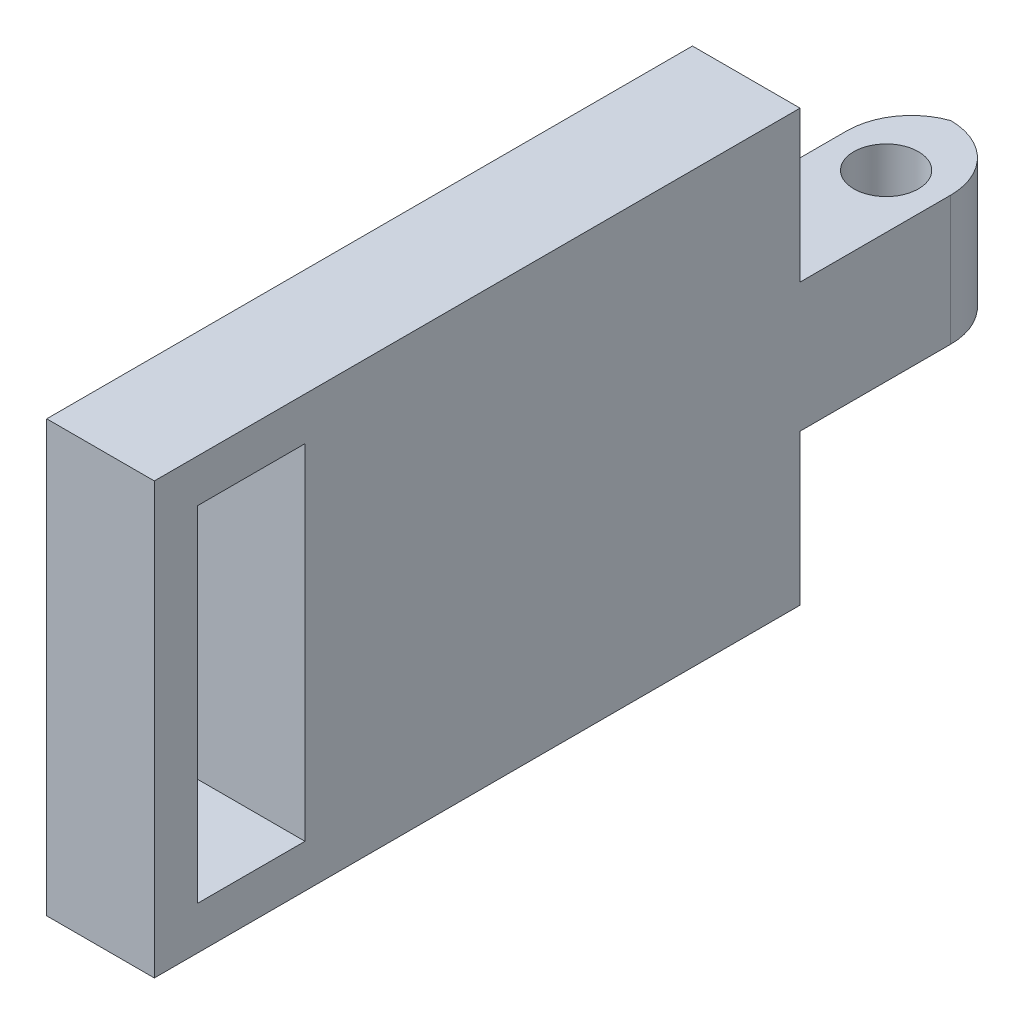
ISO-10303-21;
HEADER;
FILE_DESCRIPTION(('STEP AP214'),'2;1');
FILE_NAME('part.step','',(''),(''),'','','');
FILE_SCHEMA(('AUTOMOTIVE_DESIGN { 1 0 10303 214 1 1 1 1 }'));
ENDSEC;
DATA;
#1=APPLICATION_CONTEXT('core data for automotive mechanical design processes');
#2=APPLICATION_PROTOCOL_DEFINITION('international standard','automotive_design',2000,#1);
#3=PRODUCT_CONTEXT('',#1,'mechanical');
#4=PRODUCT('Part','Part','',(#3));
#5=PRODUCT_RELATED_PRODUCT_CATEGORY('part','',(#4));
#6=PRODUCT_DEFINITION_FORMATION('','',#4);
#7=PRODUCT_DEFINITION_CONTEXT('part definition',#1,'design');
#8=PRODUCT_DEFINITION('design','',#6,#7);
#9=PRODUCT_DEFINITION_SHAPE('','',#8);
#10=(LENGTH_UNIT() NAMED_UNIT(*) SI_UNIT(.MILLI.,.METRE.));
#11=(NAMED_UNIT(*) PLANE_ANGLE_UNIT() SI_UNIT($,.RADIAN.));
#12=(NAMED_UNIT(*) SI_UNIT($,.STERADIAN.) SOLID_ANGLE_UNIT());
#13=UNCERTAINTY_MEASURE_WITH_UNIT(LENGTH_MEASURE(1.E-05),#10,'distance_accuracy_value','');
#14=(GEOMETRIC_REPRESENTATION_CONTEXT(3) GLOBAL_UNCERTAINTY_ASSIGNED_CONTEXT((#13)) GLOBAL_UNIT_ASSIGNED_CONTEXT((#10,
#11,#12)) REPRESENTATION_CONTEXT('',''));
#15=CARTESIAN_POINT('',(0.,0.,0.));
#16=DIRECTION('',(0.,0.,1.));
#17=DIRECTION('',(1.,0.,0.));
#18=AXIS2_PLACEMENT_3D('',#15,#16,#17);
#19=CARTESIAN_POINT('',(5.,0.,-30.));
#20=DIRECTION('',(0.,0.,1.));
#21=DIRECTION('',(1.,0.,0.));
#22=AXIS2_PLACEMENT_3D('',#19,#20,#21);
#23=PLANE('',#22);
#24=DIRECTION('',(1.,0.,0.));
#25=VECTOR('',#24,1.);
#26=CARTESIAN_POINT('',(5.,13.,-30.));
#27=LINE('',#26,#25);
#28=CARTESIAN_POINT('',(0.,13.,-30.));
#29=VERTEX_POINT('',#28);
#30=CARTESIAN_POINT('',(5.,13.,-30.));
#31=VERTEX_POINT('',#30);
#32=EDGE_CURVE('E182',#29,#31,#27,.T.);
#33=ORIENTED_EDGE('',*,*,#32,.F.);
#34=DIRECTION('',(0.,1.,0.));
#35=VECTOR('',#34,1.);
#36=CARTESIAN_POINT('',(0.,0.,-30.));
#37=LINE('',#36,#35);
#38=CARTESIAN_POINT('',(0.,20.,-30.));
#39=VERTEX_POINT('',#38);
#40=EDGE_CURVE('E222',#29,#39,#37,.T.);
#41=ORIENTED_EDGE('',*,*,#40,.T.);
#42=DIRECTION('',(-1.,0.,0.));
#43=VECTOR('',#42,1.);
#44=CARTESIAN_POINT('',(5.,20.,-30.));
#45=LINE('',#44,#43);
#46=CARTESIAN_POINT('',(5.,20.,-30.));
#47=VERTEX_POINT('',#46);
#48=EDGE_CURVE('E232',#47,#39,#45,.T.);
#49=ORIENTED_EDGE('',*,*,#48,.F.);
#50=DIRECTION('',(0.,1.,0.));
#51=VECTOR('',#50,1.);
#52=CARTESIAN_POINT('',(5.,0.,-30.));
#53=LINE('',#52,#51);
#54=EDGE_CURVE('E207',#31,#47,#53,.T.);
#55=ORIENTED_EDGE('',*,*,#54,.F.);
#56=EDGE_LOOP('',(#33,#41,#49,#55));
#57=FACE_BOUND('',#56,.T.);
#58=ADVANCED_FACE('F43',(#57),#23,.F.);
#59=DIRECTION('',(-1.,0.,0.));
#60=VECTOR('',#59,1.);
#61=CARTESIAN_POINT('',(5.,7.,-30.));
#62=LINE('',#61,#60);
#63=CARTESIAN_POINT('',(5.,7.,-30.));
#64=VERTEX_POINT('',#63);
#65=CARTESIAN_POINT('',(0.,7.,-30.));
#66=VERTEX_POINT('',#65);
#67=EDGE_CURVE('E178',#64,#66,#62,.T.);
#68=ORIENTED_EDGE('',*,*,#67,.F.);
#69=CARTESIAN_POINT('',(5.,0.,-30.));
#70=VERTEX_POINT('',#69);
#71=EDGE_CURVE('E208',#70,#64,#53,.T.);
#72=ORIENTED_EDGE('',*,*,#71,.F.);
#73=DIRECTION('',(-1.,0.,0.));
#74=VECTOR('',#73,1.);
#75=CARTESIAN_POINT('',(5.,0.,-30.));
#76=LINE('',#75,#74);
#77=CARTESIAN_POINT('',(0.,0.,-30.));
#78=VERTEX_POINT('',#77);
#79=EDGE_CURVE('E236',#70,#78,#76,.T.);
#80=ORIENTED_EDGE('',*,*,#79,.T.);
#81=EDGE_CURVE('E223',#78,#66,#37,.T.);
#82=ORIENTED_EDGE('',*,*,#81,.T.);
#83=EDGE_LOOP('',(#68,#72,#80,#82));
#84=FACE_BOUND('',#83,.T.);
#85=ADVANCED_FACE('F294',(#84),#23,.F.);
#86=CARTESIAN_POINT('',(5.,0.,0.));
#87=DIRECTION('',(0.,0.,-1.));
#88=DIRECTION('',(-1.,0.,0.));
#89=AXIS2_PLACEMENT_3D('',#86,#87,#88);
#90=PLANE('',#89);
#91=DIRECTION('',(0.,-1.,0.));
#92=VECTOR('',#91,1.);
#93=CARTESIAN_POINT('',(0.,0.,0.));
#94=LINE('',#93,#92);
#95=CARTESIAN_POINT('',(0.,20.,0.));
#96=VERTEX_POINT('',#95);
#97=CARTESIAN_POINT('',(0.,0.,0.));
#98=VERTEX_POINT('',#97);
#99=EDGE_CURVE('E198',#96,#98,#94,.T.);
#100=ORIENTED_EDGE('',*,*,#99,.T.);
#101=DIRECTION('',(-1.,0.,0.));
#102=VECTOR('',#101,1.);
#103=CARTESIAN_POINT('',(5.,0.,0.));
#104=LINE('',#103,#102);
#105=CARTESIAN_POINT('',(5.,0.,0.));
#106=VERTEX_POINT('',#105);
#107=EDGE_CURVE('E240',#106,#98,#104,.T.);
#108=ORIENTED_EDGE('',*,*,#107,.F.);
#109=DIRECTION('',(0.,-1.,0.));
#110=VECTOR('',#109,1.);
#111=CARTESIAN_POINT('',(5.,0.,0.));
#112=LINE('',#111,#110);
#113=CARTESIAN_POINT('',(5.,20.,0.));
#114=VERTEX_POINT('',#113);
#115=EDGE_CURVE('E199',#114,#106,#112,.T.);
#116=ORIENTED_EDGE('',*,*,#115,.F.);
#117=DIRECTION('',(-1.,0.,0.));
#118=VECTOR('',#117,1.);
#119=CARTESIAN_POINT('',(5.,20.,0.));
#120=LINE('',#119,#118);
#121=EDGE_CURVE('E215',#114,#96,#120,.T.);
#122=ORIENTED_EDGE('',*,*,#121,.T.);
#123=EDGE_LOOP('',(#100,#108,#116,#122));
#124=FACE_BOUND('',#123,.T.);
#125=ADVANCED_FACE('F300',(#124),#90,.F.);
#126=CARTESIAN_POINT('',(5.,0.,0.));
#127=DIRECTION('',(0.,1.,0.));
#128=DIRECTION('',(0.,0.,1.));
#129=AXIS2_PLACEMENT_3D('',#126,#127,#128);
#130=PLANE('',#129);
#131=DIRECTION('',(0.,0.,-1.));
#132=VECTOR('',#131,1.);
#133=CARTESIAN_POINT('',(0.,0.,0.));
#134=LINE('',#133,#132);
#135=EDGE_CURVE('E219',#98,#78,#134,.T.);
#136=ORIENTED_EDGE('',*,*,#135,.T.);
#137=ORIENTED_EDGE('',*,*,#79,.F.);
#138=DIRECTION('',(0.,0.,-1.));
#139=VECTOR('',#138,1.);
#140=CARTESIAN_POINT('',(5.,0.,0.));
#141=LINE('',#140,#139);
#142=EDGE_CURVE('E203',#106,#70,#141,.T.);
#143=ORIENTED_EDGE('',*,*,#142,.F.);
#144=ORIENTED_EDGE('',*,*,#107,.T.);
#145=EDGE_LOOP('',(#136,#137,#143,#144));
#146=FACE_BOUND('',#145,.T.);
#147=ADVANCED_FACE('F307',(#146),#130,.F.);
#148=CARTESIAN_POINT('',(5.,20.,0.));
#149=DIRECTION('',(0.,-1.,0.));
#150=DIRECTION('',(0.,0.,-1.));
#151=AXIS2_PLACEMENT_3D('',#148,#149,#150);
#152=PLANE('',#151);
#153=DIRECTION('',(0.,0.,1.));
#154=VECTOR('',#153,1.);
#155=CARTESIAN_POINT('',(0.,20.,0.));
#156=LINE('',#155,#154);
#157=EDGE_CURVE('E204',#39,#96,#156,.T.);
#158=ORIENTED_EDGE('',*,*,#157,.T.);
#159=ORIENTED_EDGE('',*,*,#121,.F.);
#160=DIRECTION('',(0.,0.,1.));
#161=VECTOR('',#160,1.);
#162=CARTESIAN_POINT('',(5.,20.,0.));
#163=LINE('',#162,#161);
#164=EDGE_CURVE('E212',#47,#114,#163,.T.);
#165=ORIENTED_EDGE('',*,*,#164,.F.);
#166=ORIENTED_EDGE('',*,*,#48,.T.);
#167=EDGE_LOOP('',(#158,#159,#165,#166));
#168=FACE_BOUND('',#167,.T.);
#169=ADVANCED_FACE('F305',(#168),#152,.F.);
#170=CARTESIAN_POINT('',(5.,0.,0.));
#171=DIRECTION('',(-1.,0.,0.));
#172=DIRECTION('',(0.,0.,1.));
#173=AXIS2_PLACEMENT_3D('',#170,#171,#172);
#174=PLANE('',#173);
#175=DIRECTION('',(0.,-1.,0.));
#176=VECTOR('',#175,1.);
#177=CARTESIAN_POINT('',(5.,18.,-7.));
#178=LINE('',#177,#176);
#179=CARTESIAN_POINT('',(5.,18.,-7.));
#180=VERTEX_POINT('',#179);
#181=CARTESIAN_POINT('',(5.,2.,-7.));
#182=VERTEX_POINT('',#181);
#183=EDGE_CURVE('E152',#180,#182,#178,.T.);
#184=ORIENTED_EDGE('',*,*,#183,.T.);
#185=DIRECTION('',(0.,0.,1.));
#186=VECTOR('',#185,1.);
#187=CARTESIAN_POINT('',(5.,2.,-7.));
#188=LINE('',#187,#186);
#189=CARTESIAN_POINT('',(5.,2.,-2.));
#190=VERTEX_POINT('',#189);
#191=EDGE_CURVE('E142',#182,#190,#188,.T.);
#192=ORIENTED_EDGE('',*,*,#191,.T.);
#193=DIRECTION('',(0.,-1.,0.));
#194=VECTOR('',#193,1.);
#195=CARTESIAN_POINT('',(5.,18.,-2.));
#196=LINE('',#195,#194);
#197=CARTESIAN_POINT('',(5.,18.,-2.));
#198=VERTEX_POINT('',#197);
#199=EDGE_CURVE('E135',#198,#190,#196,.T.);
#200=ORIENTED_EDGE('',*,*,#199,.F.);
#201=DIRECTION('',(0.,0.,1.));
#202=VECTOR('',#201,1.);
#203=CARTESIAN_POINT('',(5.,18.,-7.));
#204=LINE('',#203,#202);
#205=EDGE_CURVE('E141',#180,#198,#204,.T.);
#206=ORIENTED_EDGE('',*,*,#205,.F.);
#207=EDGE_LOOP('',(#184,#192,#200,#206));
#208=FACE_BOUND('',#207,.T.);
#209=DIRECTION('',(0.,0.,1.));
#210=VECTOR('',#209,1.);
#211=CARTESIAN_POINT('',(5.,7.,-40.));
#212=LINE('',#211,#210);
#213=CARTESIAN_POINT('',(5.,7.,-37.));
#214=VERTEX_POINT('',#213);
#215=EDGE_CURVE('E195',#214,#64,#212,.T.);
#216=ORIENTED_EDGE('',*,*,#215,.F.);
#217=DIRECTION('',(0.,-1.,0.));
#218=VECTOR('',#217,1.);
#219=CARTESIAN_POINT('',(5.,13.,-37.));
#220=LINE('',#219,#218);
#221=CARTESIAN_POINT('',(5.,13.,-37.));
#222=VERTEX_POINT('',#221);
#223=EDGE_CURVE('E251',#214,#222,#220,.F.);
#224=ORIENTED_EDGE('',*,*,#223,.T.);
#225=DIRECTION('',(0.,0.,1.));
#226=VECTOR('',#225,1.);
#227=CARTESIAN_POINT('',(5.,13.,-40.));
#228=LINE('',#227,#226);
#229=EDGE_CURVE('E186',#222,#31,#228,.T.);
#230=ORIENTED_EDGE('',*,*,#229,.T.);
#231=ORIENTED_EDGE('',*,*,#54,.T.);
#232=ORIENTED_EDGE('',*,*,#164,.T.);
#233=ORIENTED_EDGE('',*,*,#115,.T.);
#234=ORIENTED_EDGE('',*,*,#142,.T.);
#235=ORIENTED_EDGE('',*,*,#71,.T.);
#236=EDGE_LOOP('',(#216,#224,#230,#231,#232,#233,#234,#235));
#237=FACE_BOUND('',#236,.T.);
#238=ADVANCED_FACE('F154',(#208,#237),#174,.F.);
#239=CARTESIAN_POINT('',(0.,0.,0.));
#240=DIRECTION('',(-1.,0.,0.));
#241=DIRECTION('',(0.,0.,1.));
#242=AXIS2_PLACEMENT_3D('',#239,#240,#241);
#243=PLANE('',#242);
#244=DIRECTION('',(0.,0.,1.));
#245=VECTOR('',#244,1.);
#246=CARTESIAN_POINT('',(0.,2.,0.));
#247=LINE('',#246,#245);
#248=CARTESIAN_POINT('',(0.,2.,-7.));
#249=VERTEX_POINT('',#248);
#250=CARTESIAN_POINT('',(0.,2.,-2.));
#251=VERTEX_POINT('',#250);
#252=EDGE_CURVE('E11',#249,#251,#247,.T.);
#253=ORIENTED_EDGE('',*,*,#252,.F.);
#254=DIRECTION('',(0.,-1.,0.));
#255=VECTOR('',#254,1.);
#256=CARTESIAN_POINT('',(0.,0.,-7.));
#257=LINE('',#256,#255);
#258=CARTESIAN_POINT('',(0.,18.,-7.));
#259=VERTEX_POINT('',#258);
#260=EDGE_CURVE('E52',#259,#249,#257,.T.);
#261=ORIENTED_EDGE('',*,*,#260,.F.);
#262=DIRECTION('',(0.,0.,1.));
#263=VECTOR('',#262,1.);
#264=CARTESIAN_POINT('',(0.,18.,0.));
#265=LINE('',#264,#263);
#266=CARTESIAN_POINT('',(0.,18.,-2.));
#267=VERTEX_POINT('',#266);
#268=EDGE_CURVE('E273',#259,#267,#265,.T.);
#269=ORIENTED_EDGE('',*,*,#268,.T.);
#270=DIRECTION('',(0.,-1.,0.));
#271=VECTOR('',#270,1.);
#272=CARTESIAN_POINT('',(0.,0.,-2.));
#273=LINE('',#272,#271);
#274=EDGE_CURVE('E267',#267,#251,#273,.T.);
#275=ORIENTED_EDGE('',*,*,#274,.T.);
#276=EDGE_LOOP('',(#253,#261,#269,#275));
#277=FACE_BOUND('',#276,.T.);
#278=DIRECTION('',(0.,0.,1.));
#279=VECTOR('',#278,1.);
#280=CARTESIAN_POINT('',(0.,13.,-40.));
#281=LINE('',#280,#279);
#282=CARTESIAN_POINT('',(0.,13.,-37.1715728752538));
#283=VERTEX_POINT('',#282);
#284=EDGE_CURVE('E189',#283,#29,#281,.T.);
#285=ORIENTED_EDGE('',*,*,#284,.F.);
#286=DIRECTION('',(0.,1.,0.));
#287=VECTOR('',#286,1.);
#288=CARTESIAN_POINT('',(0.,7.,-37.1715728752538));
#289=LINE('',#288,#287);
#290=CARTESIAN_POINT('',(0.,7.,-37.1715728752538));
#291=VERTEX_POINT('',#290);
#292=EDGE_CURVE('E261',#283,#291,#289,.F.);
#293=ORIENTED_EDGE('',*,*,#292,.T.);
#294=DIRECTION('',(0.,0.,1.));
#295=VECTOR('',#294,1.);
#296=CARTESIAN_POINT('',(0.,7.,-40.));
#297=LINE('',#296,#295);
#298=EDGE_CURVE('E192',#291,#66,#297,.T.);
#299=ORIENTED_EDGE('',*,*,#298,.T.);
#300=ORIENTED_EDGE('',*,*,#81,.F.);
#301=ORIENTED_EDGE('',*,*,#135,.F.);
#302=ORIENTED_EDGE('',*,*,#99,.F.);
#303=ORIENTED_EDGE('',*,*,#157,.F.);
#304=ORIENTED_EDGE('',*,*,#40,.F.);
#305=EDGE_LOOP('',(#285,#293,#299,#300,#301,#302,#303,#304));
#306=FACE_BOUND('',#305,.T.);
#307=ADVANCED_FACE('F281',(#277,#306),#243,.T.);
#308=CARTESIAN_POINT('',(5.,7.,-40.));
#309=DIRECTION('',(0.,1.,0.));
#310=DIRECTION('',(0.,0.,1.));
#311=AXIS2_PLACEMENT_3D('',#308,#309,#310);
#312=PLANE('',#311);
#313=CARTESIAN_POINT('',(2.5,7.,-36.5));
#314=DIRECTION('',(0.,1.,0.));
#315=DIRECTION('',(0.,0.,1.));
#316=AXIS2_PLACEMENT_3D('',#313,#314,#315);
#317=CIRCLE('',#316,1.5);
#318=CARTESIAN_POINT('',(2.5,7.,-38.));
#319=VERTEX_POINT('',#318);
#320=EDGE_CURVE('E174',#319,#319,#317,.T.);
#321=ORIENTED_EDGE('',*,*,#320,.T.);
#322=EDGE_LOOP('',(#321));
#323=FACE_BOUND('',#322,.T.);
#324=ORIENTED_EDGE('',*,*,#298,.F.);
#325=CARTESIAN_POINT('',(3.,7.,-37.1715728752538));
#326=DIRECTION('',(0.,1.,0.));
#327=DIRECTION('',(0.,0.,1.));
#328=AXIS2_PLACEMENT_3D('',#325,#326,#327);
#329=CIRCLE('',#328,3.);
#330=CARTESIAN_POINT('',(2.,7.,-40.));
#331=VERTEX_POINT('',#330);
#332=EDGE_CURVE('E264',#291,#331,#329,.F.);
#333=ORIENTED_EDGE('',*,*,#332,.T.);
#334=CARTESIAN_POINT('',(2.,7.,-37.));
#335=DIRECTION('',(0.,1.,0.));
#336=DIRECTION('',(0.,0.,1.));
#337=AXIS2_PLACEMENT_3D('',#334,#335,#336);
#338=CIRCLE('',#337,3.);
#339=EDGE_CURVE('E248',#331,#214,#338,.F.);
#340=ORIENTED_EDGE('',*,*,#339,.T.);
#341=ORIENTED_EDGE('',*,*,#215,.T.);
#342=ORIENTED_EDGE('',*,*,#67,.T.);
#343=EDGE_LOOP('',(#324,#333,#340,#341,#342));
#344=FACE_BOUND('',#343,.T.);
#345=ADVANCED_FACE('F323',(#323,#344),#312,.F.);
#346=CARTESIAN_POINT('',(5.,13.,-40.));
#347=DIRECTION('',(0.,-1.,0.));
#348=DIRECTION('',(0.,0.,-1.));
#349=AXIS2_PLACEMENT_3D('',#346,#347,#348);
#350=PLANE('',#349);
#351=CARTESIAN_POINT('',(2.5,13.,-36.5));
#352=DIRECTION('',(0.,-1.,0.));
#353=DIRECTION('',(0.,0.,-1.));
#354=AXIS2_PLACEMENT_3D('',#351,#352,#353);
#355=CIRCLE('',#354,1.5);
#356=CARTESIAN_POINT('',(2.5,13.,-38.));
#357=VERTEX_POINT('',#356);
#358=EDGE_CURVE('E167',#357,#357,#355,.T.);
#359=ORIENTED_EDGE('',*,*,#358,.T.);
#360=EDGE_LOOP('',(#359));
#361=FACE_BOUND('',#360,.T.);
#362=CARTESIAN_POINT('',(2.,13.,-37.));
#363=DIRECTION('',(0.,-1.,0.));
#364=DIRECTION('',(0.,0.,-1.));
#365=AXIS2_PLACEMENT_3D('',#362,#363,#364);
#366=CIRCLE('',#365,3.);
#367=CARTESIAN_POINT('',(2.,13.,-40.));
#368=VERTEX_POINT('',#367);
#369=EDGE_CURVE('E254',#222,#368,#366,.F.);
#370=ORIENTED_EDGE('',*,*,#369,.T.);
#371=CARTESIAN_POINT('',(3.,13.,-37.1715728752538));
#372=DIRECTION('',(0.,-1.,0.));
#373=DIRECTION('',(0.,0.,-1.));
#374=AXIS2_PLACEMENT_3D('',#371,#372,#373);
#375=CIRCLE('',#374,3.);
#376=EDGE_CURVE('E258',#368,#283,#375,.F.);
#377=ORIENTED_EDGE('',*,*,#376,.T.);
#378=ORIENTED_EDGE('',*,*,#284,.T.);
#379=ORIENTED_EDGE('',*,*,#32,.T.);
#380=ORIENTED_EDGE('',*,*,#229,.F.);
#381=EDGE_LOOP('',(#370,#377,#378,#379,#380));
#382=FACE_BOUND('',#381,.T.);
#383=ADVANCED_FACE('F315',(#361,#382),#350,.F.);
#384=CARTESIAN_POINT('',(2.,0.,-37.));
#385=DIRECTION('',(0.,1.,0.));
#386=DIRECTION('',(0.,0.,1.));
#387=AXIS2_PLACEMENT_3D('',#384,#385,#386);
#388=CYLINDRICAL_SURFACE('',#387,3.);
#389=ORIENTED_EDGE('',*,*,#369,.F.);
#390=ORIENTED_EDGE('',*,*,#223,.F.);
#391=ORIENTED_EDGE('',*,*,#339,.F.);
#392=DIRECTION('',(0.,-1.,0.));
#393=VECTOR('',#392,1.);
#394=CARTESIAN_POINT('',(2.,7.,-40.));
#395=LINE('',#394,#393);
#396=EDGE_CURVE('E244',#368,#331,#395,.T.);
#397=ORIENTED_EDGE('',*,*,#396,.F.);
#398=EDGE_LOOP('',(#389,#390,#391,#397));
#399=FACE_BOUND('',#398,.T.);
#400=ADVANCED_FACE('F313',(#399),#388,.T.);
#401=CARTESIAN_POINT('',(3.,0.,-37.1715728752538));
#402=DIRECTION('',(0.,-1.,0.));
#403=DIRECTION('',(0.,0.,-1.));
#404=AXIS2_PLACEMENT_3D('',#401,#402,#403);
#405=CYLINDRICAL_SURFACE('',#404,3.);
#406=ORIENTED_EDGE('',*,*,#332,.F.);
#407=ORIENTED_EDGE('',*,*,#292,.F.);
#408=ORIENTED_EDGE('',*,*,#376,.F.);
#409=ORIENTED_EDGE('',*,*,#396,.T.);
#410=EDGE_LOOP('',(#406,#407,#408,#409));
#411=FACE_BOUND('',#410,.T.);
#412=ADVANCED_FACE('F45',(#411),#405,.T.);
#413=CARTESIAN_POINT('',(2.5,20.,-36.5));
#414=DIRECTION('',(0.,-1.,0.));
#415=DIRECTION('',(0.,0.,-1.));
#416=AXIS2_PLACEMENT_3D('',#413,#414,#415);
#417=CYLINDRICAL_SURFACE('',#416,1.5);
#418=CARTESIAN_POINT('',(2.5,13.,-38.));
#419=CARTESIAN_POINT('',(2.5,12.9375,-38.));
#420=CARTESIAN_POINT('',(2.5,12.875,-38.));
#421=CARTESIAN_POINT('',(2.5,12.75,-38.));
#422=CARTESIAN_POINT('',(2.5,12.6875,-38.));
#423=CARTESIAN_POINT('',(2.5,12.5625,-38.));
#424=CARTESIAN_POINT('',(2.5,12.5,-38.));
#425=CARTESIAN_POINT('',(2.5,12.375,-38.));
#426=CARTESIAN_POINT('',(2.5,12.3125,-38.));
#427=CARTESIAN_POINT('',(2.5,12.1875,-38.));
#428=CARTESIAN_POINT('',(2.5,12.125,-38.));
#429=CARTESIAN_POINT('',(2.5,12.,-38.));
#430=CARTESIAN_POINT('',(2.5,11.9375,-38.));
#431=CARTESIAN_POINT('',(2.5,11.8125,-38.));
#432=CARTESIAN_POINT('',(2.5,11.75,-38.));
#433=CARTESIAN_POINT('',(2.5,11.625,-38.));
#434=CARTESIAN_POINT('',(2.5,11.5625,-38.));
#435=CARTESIAN_POINT('',(2.5,11.4375,-38.));
#436=CARTESIAN_POINT('',(2.5,11.375,-38.));
#437=CARTESIAN_POINT('',(2.5,11.25,-38.));
#438=CARTESIAN_POINT('',(2.5,11.1875,-38.));
#439=CARTESIAN_POINT('',(2.5,11.0625,-38.));
#440=CARTESIAN_POINT('',(2.5,11.,-38.));
#441=CARTESIAN_POINT('',(2.5,10.875,-38.));
#442=CARTESIAN_POINT('',(2.5,10.8125,-38.));
#443=CARTESIAN_POINT('',(2.5,10.6875,-38.));
#444=CARTESIAN_POINT('',(2.5,10.625,-38.));
#445=CARTESIAN_POINT('',(2.5,10.5,-38.));
#446=CARTESIAN_POINT('',(2.5,10.4375,-38.));
#447=CARTESIAN_POINT('',(2.5,10.3125,-38.));
#448=CARTESIAN_POINT('',(2.5,10.25,-38.));
#449=CARTESIAN_POINT('',(2.5,10.125,-38.));
#450=CARTESIAN_POINT('',(2.5,10.0625,-38.));
#451=CARTESIAN_POINT('',(2.5,9.9375,-38.));
#452=CARTESIAN_POINT('',(2.5,9.875,-38.));
#453=CARTESIAN_POINT('',(2.5,9.75,-38.));
#454=CARTESIAN_POINT('',(2.5,9.6875,-38.));
#455=CARTESIAN_POINT('',(2.5,9.5625,-38.));
#456=CARTESIAN_POINT('',(2.5,9.5,-38.));
#457=CARTESIAN_POINT('',(2.5,9.375,-38.));
#458=CARTESIAN_POINT('',(2.5,9.3125,-38.));
#459=CARTESIAN_POINT('',(2.5,9.1875,-38.));
#460=CARTESIAN_POINT('',(2.5,9.125,-38.));
#461=CARTESIAN_POINT('',(2.5,9.,-38.));
#462=CARTESIAN_POINT('',(2.5,8.9375,-38.));
#463=CARTESIAN_POINT('',(2.5,8.8125,-38.));
#464=CARTESIAN_POINT('',(2.5,8.75,-38.));
#465=CARTESIAN_POINT('',(2.5,8.625,-38.));
#466=CARTESIAN_POINT('',(2.5,8.5625,-38.));
#467=CARTESIAN_POINT('',(2.5,8.4375,-38.));
#468=CARTESIAN_POINT('',(2.5,8.375,-38.));
#469=CARTESIAN_POINT('',(2.5,8.25,-38.));
#470=CARTESIAN_POINT('',(2.5,8.1875,-38.));
#471=CARTESIAN_POINT('',(2.5,8.0625,-38.));
#472=CARTESIAN_POINT('',(2.5,8.,-38.));
#473=CARTESIAN_POINT('',(2.5,7.875,-38.));
#474=CARTESIAN_POINT('',(2.5,7.8125,-38.));
#475=CARTESIAN_POINT('',(2.5,7.6875,-38.));
#476=CARTESIAN_POINT('',(2.5,7.625,-38.));
#477=CARTESIAN_POINT('',(2.5,7.5,-38.));
#478=CARTESIAN_POINT('',(2.5,7.4375,-38.));
#479=CARTESIAN_POINT('',(2.5,7.3125,-38.));
#480=CARTESIAN_POINT('',(2.5,7.25,-38.));
#481=CARTESIAN_POINT('',(2.5,7.125,-38.));
#482=CARTESIAN_POINT('',(2.5,7.0625,-38.));
#483=CARTESIAN_POINT('',(2.5,7.,-38.));
#484=B_SPLINE_CURVE_WITH_KNOTS('',3,(#418,#419,#420,#421,#422,#423,#424,#425,#426,#427,#428,
#429,#430,#431,#432,#433,#434,#435,#436,#437,#438,#439,#440,#441,#442,#443,#444,#445,#446,#447,
#448,#449,#450,#451,#452,#453,#454,#455,#456,#457,#458,#459,#460,#461,#462,#463,#464,#465,#466,
#467,#468,#469,#470,#471,#472,#473,#474,#475,#476,#477,#478,#479,#480,#481,#482,#483),
.UNSPECIFIED.,.F.,.F.,(4,2,2,2,2,2,2,2,2,2,2,2,2,2,2,2,2,2,2,2,2,2,2,2,2,2,2,2,2,2,2,2,4),(0.,
0.1875,0.375,0.5625,0.750000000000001,0.937499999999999,1.125,1.3125,1.5,1.6875,1.875,2.0625,
2.25,2.4375,2.625,2.8125,3.,3.1875,3.375,3.5625,3.75,3.9375,4.125,4.3125,4.5,4.6875,4.875,
5.0625,5.25,5.4375,5.625,5.8125,6.),.UNSPECIFIED.);
#485=EDGE_CURVE('BSEAM321',#357,#319,#484,.T.);
#486=ORIENTED_EDGE('',*,*,#358,.F.);
#487=ORIENTED_EDGE('',*,*,#320,.F.);
#488=ORIENTED_EDGE('',*,*,#485,.T.);
#489=ORIENTED_EDGE('',*,*,#485,.F.);
#490=EDGE_LOOP('',(#486,#488,#487,#489));
#491=FACE_BOUND('',#490,.T.);
#492=ADVANCED_FACE('F321',(#491),#417,.F.);
#493=CARTESIAN_POINT('',(5.,2.,-7.));
#494=DIRECTION('',(0.,-1.,0.));
#495=DIRECTION('',(0.,0.,-1.));
#496=AXIS2_PLACEMENT_3D('',#493,#494,#495);
#497=PLANE('',#496);
#498=ORIENTED_EDGE('',*,*,#252,.T.);
#499=DIRECTION('',(-1.,0.,0.));
#500=VECTOR('',#499,1.);
#501=CARTESIAN_POINT('',(5.,2.,-2.));
#502=LINE('',#501,#500);
#503=EDGE_CURVE('E64',#190,#251,#502,.T.);
#504=ORIENTED_EDGE('',*,*,#503,.F.);
#505=ORIENTED_EDGE('',*,*,#191,.F.);
#506=DIRECTION('',(-1.,0.,0.));
#507=VECTOR('',#506,1.);
#508=CARTESIAN_POINT('',(5.,2.,-7.));
#509=LINE('',#508,#507);
#510=EDGE_CURVE('E164',#182,#249,#509,.T.);
#511=ORIENTED_EDGE('',*,*,#510,.T.);
#512=EDGE_LOOP('',(#498,#504,#505,#511));
#513=FACE_BOUND('',#512,.T.);
#514=ADVANCED_FACE('F146',(#513),#497,.F.);
#515=CARTESIAN_POINT('',(5.,18.,-7.));
#516=DIRECTION('',(0.,0.,-1.));
#517=DIRECTION('',(0.,1.,0.));
#518=AXIS2_PLACEMENT_3D('',#515,#516,#517);
#519=PLANE('',#518);
#520=ORIENTED_EDGE('',*,*,#260,.T.);
#521=ORIENTED_EDGE('',*,*,#510,.F.);
#522=ORIENTED_EDGE('',*,*,#183,.F.);
#523=DIRECTION('',(-1.,0.,0.));
#524=VECTOR('',#523,1.);
#525=CARTESIAN_POINT('',(5.,18.,-7.));
#526=LINE('',#525,#524);
#527=EDGE_CURVE('E168',#180,#259,#526,.T.);
#528=ORIENTED_EDGE('',*,*,#527,.T.);
#529=EDGE_LOOP('',(#520,#521,#522,#528));
#530=FACE_BOUND('',#529,.T.);
#531=ADVANCED_FACE('F279',(#530),#519,.F.);
#532=CARTESIAN_POINT('',(5.,18.,-7.));
#533=DIRECTION('',(0.,-1.,0.));
#534=DIRECTION('',(0.,0.,-1.));
#535=AXIS2_PLACEMENT_3D('',#532,#533,#534);
#536=PLANE('',#535);
#537=ORIENTED_EDGE('',*,*,#527,.F.);
#538=ORIENTED_EDGE('',*,*,#205,.T.);
#539=DIRECTION('',(-1.,0.,0.));
#540=VECTOR('',#539,1.);
#541=CARTESIAN_POINT('',(5.,18.,-2.));
#542=LINE('',#541,#540);
#543=EDGE_CURVE('E59',#198,#267,#542,.T.);
#544=ORIENTED_EDGE('',*,*,#543,.T.);
#545=ORIENTED_EDGE('',*,*,#268,.F.);
#546=EDGE_LOOP('',(#537,#538,#544,#545));
#547=FACE_BOUND('',#546,.T.);
#548=ADVANCED_FACE('F284',(#547),#536,.T.);
#549=CARTESIAN_POINT('',(5.,18.,-2.));
#550=DIRECTION('',(0.,0.,-1.));
#551=DIRECTION('',(0.,1.,0.));
#552=AXIS2_PLACEMENT_3D('',#549,#550,#551);
#553=PLANE('',#552);
#554=ORIENTED_EDGE('',*,*,#543,.F.);
#555=ORIENTED_EDGE('',*,*,#199,.T.);
#556=ORIENTED_EDGE('',*,*,#503,.T.);
#557=ORIENTED_EDGE('',*,*,#274,.F.);
#558=EDGE_LOOP('',(#554,#555,#556,#557));
#559=FACE_BOUND('',#558,.T.);
#560=ADVANCED_FACE('F136',(#559),#553,.T.);
#561=CLOSED_SHELL('',(#58,#85,#125,#147,#169,#238,#307,#345,#383,#400,#412,#492,#514,#531,#548,#560));
#562=MANIFOLD_SOLID_BREP('B2',#561);
#563=ADVANCED_BREP_SHAPE_REPRESENTATION('',(#18,#562),#14);
#564=SHAPE_DEFINITION_REPRESENTATION(#9,#563);
ENDSEC;
END-ISO-10303-21;
